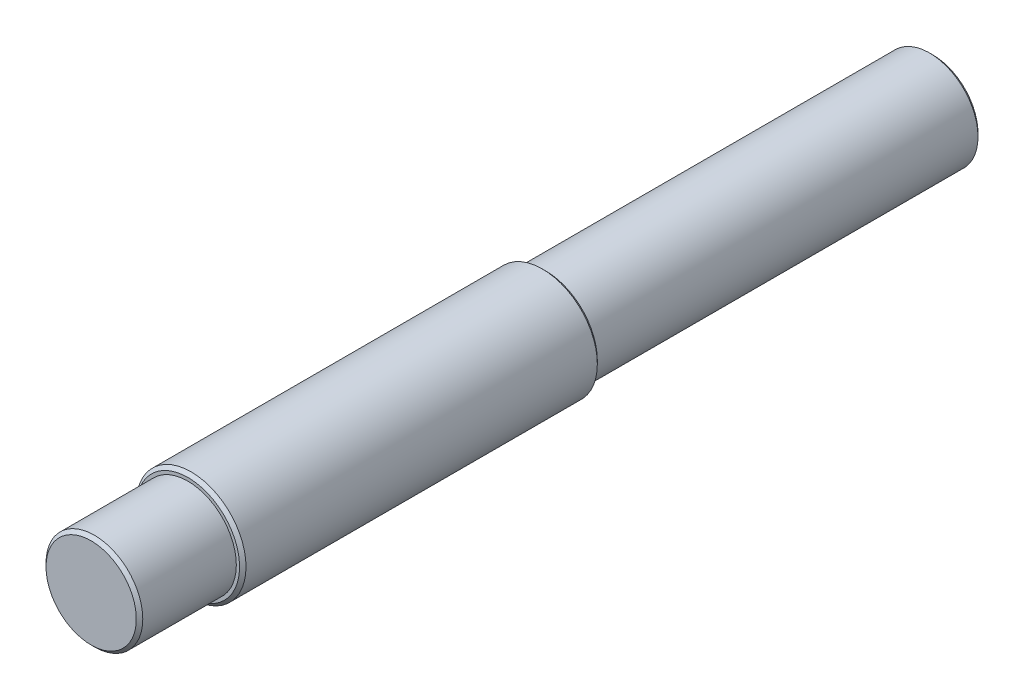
ISO-10303-21;
HEADER;
FILE_DESCRIPTION(('STEP AP214'),'2;1');
FILE_NAME('part.step','',(''),(''),'','','');
FILE_SCHEMA(('AUTOMOTIVE_DESIGN { 1 0 10303 214 1 1 1 1 }'));
ENDSEC;
DATA;
#1=APPLICATION_CONTEXT('core data for automotive mechanical design processes');
#2=APPLICATION_PROTOCOL_DEFINITION('international standard','automotive_design',2000,#1);
#3=PRODUCT_CONTEXT('',#1,'mechanical');
#4=PRODUCT('Part','Part','',(#3));
#5=PRODUCT_RELATED_PRODUCT_CATEGORY('part','',(#4));
#6=PRODUCT_DEFINITION_FORMATION('','',#4);
#7=PRODUCT_DEFINITION_CONTEXT('part definition',#1,'design');
#8=PRODUCT_DEFINITION('design','',#6,#7);
#9=PRODUCT_DEFINITION_SHAPE('','',#8);
#10=(LENGTH_UNIT() NAMED_UNIT(*) SI_UNIT(.MILLI.,.METRE.));
#11=(NAMED_UNIT(*) PLANE_ANGLE_UNIT() SI_UNIT($,.RADIAN.));
#12=(NAMED_UNIT(*) SI_UNIT($,.STERADIAN.) SOLID_ANGLE_UNIT());
#13=UNCERTAINTY_MEASURE_WITH_UNIT(LENGTH_MEASURE(1.E-05),#10,'distance_accuracy_value','');
#14=(GEOMETRIC_REPRESENTATION_CONTEXT(3) GLOBAL_UNCERTAINTY_ASSIGNED_CONTEXT((#13)) GLOBAL_UNIT_ASSIGNED_CONTEXT((#10,
#11,#12)) REPRESENTATION_CONTEXT('',''));
#15=CARTESIAN_POINT('',(0.,0.,0.));
#16=DIRECTION('',(0.,0.,1.));
#17=DIRECTION('',(1.,0.,0.));
#18=AXIS2_PLACEMENT_3D('',#15,#16,#17);
#19=CARTESIAN_POINT('',(0.,0.,13.045));
#20=DIRECTION('',(0.,0.,-1.));
#21=DIRECTION('',(-1.,0.,0.));
#22=AXIS2_PLACEMENT_3D('',#19,#20,#21);
#23=PLANE('',#22);
#24=CARTESIAN_POINT('',(0.,0.,13.045));
#25=DIRECTION('',(0.,0.,-1.));
#26=DIRECTION('',(-1.,0.,0.));
#27=AXIS2_PLACEMENT_3D('',#24,#25,#26);
#28=CIRCLE('',#27,1.40000000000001);
#29=CARTESIAN_POINT('',(-1.40000000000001,0.,13.045));
#30=VERTEX_POINT('',#29);
#31=EDGE_CURVE('E36',#30,#30,#28,.F.);
#32=ORIENTED_EDGE('',*,*,#31,.T.);
#33=EDGE_LOOP('',(#32));
#34=FACE_BOUND('',#33,.T.);
#35=ADVANCED_FACE('F29',(#34),#23,.F.);
#36=CARTESIAN_POINT('',(0.,0.,13.045));
#37=DIRECTION('',(0.,0.,1.));
#38=DIRECTION('',(1.,0.,0.));
#39=AXIS2_PLACEMENT_3D('',#36,#37,#38);
#40=CYLINDRICAL_SURFACE('',#39,1.5);
#41=CARTESIAN_POINT('',(0.,0.,12.945));
#42=DIRECTION('',(0.,0.,-1.));
#43=DIRECTION('',(-1.,0.,0.));
#44=AXIS2_PLACEMENT_3D('',#41,#42,#43);
#45=CIRCLE('',#44,1.5);
#46=CARTESIAN_POINT('',(-1.5,0.,12.945));
#47=VERTEX_POINT('',#46);
#48=EDGE_CURVE('E10',#47,#47,#45,.T.);
#49=ORIENTED_EDGE('',*,*,#48,.T.);
#50=EDGE_LOOP('',(#49));
#51=FACE_BOUND('',#50,.T.);
#52=CARTESIAN_POINT('',(0.,0.,10.045));
#53=DIRECTION('',(0.,0.,1.));
#54=DIRECTION('',(1.,0.,0.));
#55=AXIS2_PLACEMENT_3D('',#52,#53,#54);
#56=CIRCLE('',#55,1.5);
#57=CARTESIAN_POINT('',(1.5,0.,10.045));
#58=VERTEX_POINT('',#57);
#59=EDGE_CURVE('E61',#58,#58,#56,.T.);
#60=ORIENTED_EDGE('',*,*,#59,.T.);
#61=EDGE_LOOP('',(#60));
#62=FACE_BOUND('',#61,.T.);
#63=ADVANCED_FACE('F86',(#51,#62),#40,.T.);
#64=CARTESIAN_POINT('',(0.,1.5,10.045));
#65=DIRECTION('',(0.,0.,-1.));
#66=DIRECTION('',(-1.,0.,0.));
#67=AXIS2_PLACEMENT_3D('',#64,#65,#66);
#68=PLANE('',#67);
#69=CARTESIAN_POINT('',(0.,0.,10.045));
#70=DIRECTION('',(0.,0.,-1.));
#71=DIRECTION('',(-1.,0.,0.));
#72=AXIS2_PLACEMENT_3D('',#69,#70,#71);
#73=CIRCLE('',#72,1.6);
#74=CARTESIAN_POINT('',(-1.6,0.,10.045));
#75=VERTEX_POINT('',#74);
#76=EDGE_CURVE('E49',#75,#75,#73,.F.);
#77=ORIENTED_EDGE('',*,*,#76,.T.);
#78=EDGE_LOOP('',(#77));
#79=FACE_BOUND('',#78,.T.);
#80=ORIENTED_EDGE('',*,*,#59,.F.);
#81=EDGE_LOOP('',(#80));
#82=FACE_BOUND('',#81,.T.);
#83=ADVANCED_FACE('F91',(#79,#82),#68,.F.);
#84=CARTESIAN_POINT('',(0.,0.,13.045));
#85=DIRECTION('',(0.,0.,1.));
#86=DIRECTION('',(1.,0.,0.));
#87=AXIS2_PLACEMENT_3D('',#84,#85,#86);
#88=CYLINDRICAL_SURFACE('',#87,1.7);
#89=CARTESIAN_POINT('',(0.,0.,-0.945000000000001));
#90=DIRECTION('',(0.,0.,1.));
#91=DIRECTION('',(1.,0.,0.));
#92=AXIS2_PLACEMENT_3D('',#89,#90,#91);
#93=CIRCLE('',#92,1.7);
#94=CARTESIAN_POINT('',(1.7,0.,-0.945000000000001));
#95=VERTEX_POINT('',#94);
#96=EDGE_CURVE('E55',#95,#95,#93,.T.);
#97=ORIENTED_EDGE('',*,*,#96,.T.);
#98=EDGE_LOOP('',(#97));
#99=FACE_BOUND('',#98,.T.);
#100=CARTESIAN_POINT('',(0.,0.,9.94500000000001));
#101=DIRECTION('',(0.,0.,-1.));
#102=DIRECTION('',(-1.,0.,0.));
#103=AXIS2_PLACEMENT_3D('',#100,#101,#102);
#104=CIRCLE('',#103,1.7);
#105=CARTESIAN_POINT('',(-1.7,0.,9.94500000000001));
#106=VERTEX_POINT('',#105);
#107=EDGE_CURVE('E58',#106,#106,#104,.T.);
#108=ORIENTED_EDGE('',*,*,#107,.T.);
#109=EDGE_LOOP('',(#108));
#110=FACE_BOUND('',#109,.T.);
#111=ADVANCED_FACE('F82',(#99,#110),#88,.T.);
#112=CARTESIAN_POINT('',(0.,1.7,-1.045));
#113=DIRECTION('',(0.,0.,1.));
#114=DIRECTION('',(1.,0.,0.));
#115=AXIS2_PLACEMENT_3D('',#112,#113,#114);
#116=PLANE('',#115);
#117=CARTESIAN_POINT('',(0.,0.,-1.045));
#118=DIRECTION('',(0.,0.,1.));
#119=DIRECTION('',(1.,0.,0.));
#120=AXIS2_PLACEMENT_3D('',#117,#118,#119);
#121=CIRCLE('',#120,1.6);
#122=CARTESIAN_POINT('',(1.6,0.,-1.045));
#123=VERTEX_POINT('',#122);
#124=EDGE_CURVE('E52',#123,#123,#121,.F.);
#125=ORIENTED_EDGE('',*,*,#124,.T.);
#126=EDGE_LOOP('',(#125));
#127=FACE_BOUND('',#126,.T.);
#128=CARTESIAN_POINT('',(0.,0.,-1.045));
#129=DIRECTION('',(0.,0.,1.));
#130=DIRECTION('',(1.,0.,0.));
#131=AXIS2_PLACEMENT_3D('',#128,#129,#130);
#132=CIRCLE('',#131,1.5);
#133=CARTESIAN_POINT('',(1.5,0.,-1.045));
#134=VERTEX_POINT('',#133);
#135=EDGE_CURVE('E64',#134,#134,#132,.T.);
#136=ORIENTED_EDGE('',*,*,#135,.T.);
#137=EDGE_LOOP('',(#136));
#138=FACE_BOUND('',#137,.T.);
#139=ADVANCED_FACE('F68',(#127,#138),#116,.F.);
#140=CARTESIAN_POINT('',(0.,0.,13.045));
#141=DIRECTION('',(0.,0.,1.));
#142=DIRECTION('',(1.,0.,0.));
#143=AXIS2_PLACEMENT_3D('',#140,#141,#142);
#144=CYLINDRICAL_SURFACE('',#143,1.5);
#145=CARTESIAN_POINT('',(0.,0.,-12.945));
#146=DIRECTION('',(0.,0.,1.));
#147=DIRECTION('',(1.,0.,0.));
#148=AXIS2_PLACEMENT_3D('',#145,#146,#147);
#149=CIRCLE('',#148,1.5);
#150=CARTESIAN_POINT('',(1.5,0.,-12.945));
#151=VERTEX_POINT('',#150);
#152=EDGE_CURVE('E44',#151,#151,#149,.T.);
#153=ORIENTED_EDGE('',*,*,#152,.T.);
#154=EDGE_LOOP('',(#153));
#155=FACE_BOUND('',#154,.T.);
#156=ORIENTED_EDGE('',*,*,#135,.F.);
#157=EDGE_LOOP('',(#156));
#158=FACE_BOUND('',#157,.T.);
#159=ADVANCED_FACE('F70',(#155,#158),#144,.T.);
#160=CARTESIAN_POINT('',(0.,1.5,-13.045));
#161=DIRECTION('',(0.,0.,1.));
#162=DIRECTION('',(1.,0.,0.));
#163=AXIS2_PLACEMENT_3D('',#160,#161,#162);
#164=PLANE('',#163);
#165=CARTESIAN_POINT('',(0.,0.,-13.045));
#166=DIRECTION('',(0.,0.,1.));
#167=DIRECTION('',(1.,0.,0.));
#168=AXIS2_PLACEMENT_3D('',#165,#166,#167);
#169=CIRCLE('',#168,1.4);
#170=CARTESIAN_POINT('',(1.4,0.,-13.045));
#171=VERTEX_POINT('',#170);
#172=EDGE_CURVE('E40',#171,#171,#169,.F.);
#173=ORIENTED_EDGE('',*,*,#172,.T.);
#174=EDGE_LOOP('',(#173));
#175=FACE_BOUND('',#174,.T.);
#176=ADVANCED_FACE('F72',(#175),#164,.F.);
#177=CARTESIAN_POINT('',(0.,0.,-0.945000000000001));
#178=DIRECTION('',(0.,0.,1.));
#179=DIRECTION('',(1.,0.,0.));
#180=AXIS2_PLACEMENT_3D('',#177,#178,#179);
#181=CONICAL_SURFACE('',#180,1.7,0.785398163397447);
#182=ORIENTED_EDGE('',*,*,#124,.F.);
#183=EDGE_LOOP('',(#182));
#184=FACE_BOUND('',#183,.T.);
#185=ORIENTED_EDGE('',*,*,#96,.F.);
#186=EDGE_LOOP('',(#185));
#187=FACE_BOUND('',#186,.T.);
#188=ADVANCED_FACE('F79',(#184,#187),#181,.T.);
#189=CARTESIAN_POINT('',(0.,0.,10.045));
#190=DIRECTION('',(0.,0.,-1.));
#191=DIRECTION('',(-1.,0.,0.));
#192=AXIS2_PLACEMENT_3D('',#189,#190,#191);
#193=CONICAL_SURFACE('',#192,1.6,0.785398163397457);
#194=CARTESIAN_POINT('',(-1.7,0.,9.94500000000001));
#195=CARTESIAN_POINT('',(-1.69895833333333,0.,9.94604166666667));
#196=CARTESIAN_POINT('',(-1.69791666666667,0.,9.94708333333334));
#197=CARTESIAN_POINT('',(-1.69583333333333,0.,9.94916666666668));
#198=CARTESIAN_POINT('',(-1.69479166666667,0.,9.95020833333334));
#199=CARTESIAN_POINT('',(-1.69270833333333,0.,9.95229166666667));
#200=CARTESIAN_POINT('',(-1.69166666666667,0.,9.95333333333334));
#201=CARTESIAN_POINT('',(-1.68958333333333,0.,9.95541666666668));
#202=CARTESIAN_POINT('',(-1.68854166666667,0.,9.95645833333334));
#203=CARTESIAN_POINT('',(-1.68645833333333,0.,9.95854166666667));
#204=CARTESIAN_POINT('',(-1.68541666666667,0.,9.95958333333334));
#205=CARTESIAN_POINT('',(-1.68333333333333,0.,9.96166666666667));
#206=CARTESIAN_POINT('',(-1.68229166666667,0.,9.96270833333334));
#207=CARTESIAN_POINT('',(-1.68020833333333,0.,9.96479166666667));
#208=CARTESIAN_POINT('',(-1.67916666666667,0.,9.96583333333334));
#209=CARTESIAN_POINT('',(-1.67708333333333,0.,9.96791666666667));
#210=CARTESIAN_POINT('',(-1.67604166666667,0.,9.96895833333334));
#211=CARTESIAN_POINT('',(-1.67395833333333,0.,9.97104166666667));
#212=CARTESIAN_POINT('',(-1.67291666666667,0.,9.97208333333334));
#213=CARTESIAN_POINT('',(-1.67083333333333,0.,9.97416666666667));
#214=CARTESIAN_POINT('',(-1.66979166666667,0.,9.97520833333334));
#215=CARTESIAN_POINT('',(-1.66770833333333,0.,9.97729166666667));
#216=CARTESIAN_POINT('',(-1.66666666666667,0.,9.97833333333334));
#217=CARTESIAN_POINT('',(-1.66458333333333,0.,9.98041666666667));
#218=CARTESIAN_POINT('',(-1.66354166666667,0.,9.98145833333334));
#219=CARTESIAN_POINT('',(-1.66145833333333,0.,9.98354166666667));
#220=CARTESIAN_POINT('',(-1.66041666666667,0.,9.98458333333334));
#221=CARTESIAN_POINT('',(-1.65833333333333,0.,9.98666666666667));
#222=CARTESIAN_POINT('',(-1.65729166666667,0.,9.98770833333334));
#223=CARTESIAN_POINT('',(-1.65520833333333,0.,9.98979166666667));
#224=CARTESIAN_POINT('',(-1.65416666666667,0.,9.99083333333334));
#225=CARTESIAN_POINT('',(-1.65208333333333,0.,9.99291666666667));
#226=CARTESIAN_POINT('',(-1.65104166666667,0.,9.99395833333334));
#227=CARTESIAN_POINT('',(-1.64895833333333,0.,9.99604166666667));
#228=CARTESIAN_POINT('',(-1.64791666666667,0.,9.99708333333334));
#229=CARTESIAN_POINT('',(-1.64583333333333,0.,9.99916666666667));
#230=CARTESIAN_POINT('',(-1.64479166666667,0.,10.0002083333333));
#231=CARTESIAN_POINT('',(-1.64270833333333,0.,10.0022916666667));
#232=CARTESIAN_POINT('',(-1.64166666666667,0.,10.0033333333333));
#233=CARTESIAN_POINT('',(-1.63958333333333,0.,10.0054166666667));
#234=CARTESIAN_POINT('',(-1.63854166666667,0.,10.0064583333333));
#235=CARTESIAN_POINT('',(-1.63645833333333,0.,10.0085416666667));
#236=CARTESIAN_POINT('',(-1.63541666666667,0.,10.0095833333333));
#237=CARTESIAN_POINT('',(-1.63333333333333,0.,10.0116666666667));
#238=CARTESIAN_POINT('',(-1.63229166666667,0.,10.0127083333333));
#239=CARTESIAN_POINT('',(-1.63020833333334,0.,10.0147916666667));
#240=CARTESIAN_POINT('',(-1.62916666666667,0.,10.0158333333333));
#241=CARTESIAN_POINT('',(-1.62708333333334,0.,10.0179166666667));
#242=CARTESIAN_POINT('',(-1.62604166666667,0.,10.0189583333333));
#243=CARTESIAN_POINT('',(-1.62395833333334,0.,10.0210416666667));
#244=CARTESIAN_POINT('',(-1.62291666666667,0.,10.0220833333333));
#245=CARTESIAN_POINT('',(-1.62083333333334,0.,10.0241666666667));
#246=CARTESIAN_POINT('',(-1.61979166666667,0.,10.0252083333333));
#247=CARTESIAN_POINT('',(-1.61770833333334,0.,10.0272916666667));
#248=CARTESIAN_POINT('',(-1.61666666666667,0.,10.0283333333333));
#249=CARTESIAN_POINT('',(-1.61458333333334,0.,10.0304166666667));
#250=CARTESIAN_POINT('',(-1.61354166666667,0.,10.0314583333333));
#251=CARTESIAN_POINT('',(-1.61145833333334,0.,10.0335416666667));
#252=CARTESIAN_POINT('',(-1.61041666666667,0.,10.0345833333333));
#253=CARTESIAN_POINT('',(-1.60833333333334,0.,10.0366666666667));
#254=CARTESIAN_POINT('',(-1.60729166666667,0.,10.0377083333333));
#255=CARTESIAN_POINT('',(-1.60520833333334,0.,10.0397916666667));
#256=CARTESIAN_POINT('',(-1.60416666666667,0.,10.0408333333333));
#257=CARTESIAN_POINT('',(-1.60208333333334,0.,10.0429166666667));
#258=CARTESIAN_POINT('',(-1.60104166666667,0.,10.0439583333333));
#259=CARTESIAN_POINT('',(-1.6,0.,10.045));
#260=B_SPLINE_CURVE_WITH_KNOTS('',3,(#194,#195,#196,#197,#198,#199,#200,#201,#202,#203,#204,
#205,#206,#207,#208,#209,#210,#211,#212,#213,#214,#215,#216,#217,#218,#219,#220,#221,#222,#223,
#224,#225,#226,#227,#228,#229,#230,#231,#232,#233,#234,#235,#236,#237,#238,#239,#240,#241,#242,
#243,#244,#245,#246,#247,#248,#249,#250,#251,#252,#253,#254,#255,#256,#257,#258,#259),
.UNSPECIFIED.,.F.,.F.,(4,2,2,2,2,2,2,2,2,2,2,2,2,2,2,2,2,2,2,2,2,2,2,2,2,2,2,2,2,2,2,2,4),(0.,
0.00441941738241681,0.0088388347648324,0.013258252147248,0.0176776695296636,0.0220970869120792,
0.0265165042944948,0.0309359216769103,0.0353553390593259,0.0397747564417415,0.0441941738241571,
0.0486135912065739,0.0530330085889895,0.0574524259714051,0.0618718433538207,0.0662912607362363,
0.0707106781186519,0.0751300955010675,0.079549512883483,0.0839689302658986,0.0883883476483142,
0.0928077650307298,0.0972271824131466,0.101646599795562,0.106066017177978,0.110485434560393,
0.114904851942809,0.119324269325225,0.12374368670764,0.128163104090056,0.132582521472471,
0.137001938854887,0.141421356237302),.UNSPECIFIED.);
#261=EDGE_CURVE('BSEAM97',#106,#75,#260,.T.);
#262=ORIENTED_EDGE('',*,*,#107,.F.);
#263=ORIENTED_EDGE('',*,*,#76,.F.);
#264=ORIENTED_EDGE('',*,*,#261,.T.);
#265=ORIENTED_EDGE('',*,*,#261,.F.);
#266=EDGE_LOOP('',(#262,#264,#263,#265));
#267=FACE_BOUND('',#266,.T.);
#268=ADVANCED_FACE('F97',(#267),#193,.T.);
#269=CARTESIAN_POINT('',(0.,0.,-12.945));
#270=DIRECTION('',(0.,0.,1.));
#271=DIRECTION('',(1.,0.,0.));
#272=AXIS2_PLACEMENT_3D('',#269,#270,#271);
#273=CONICAL_SURFACE('',#272,1.5,0.785398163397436);
#274=ORIENTED_EDGE('',*,*,#172,.F.);
#275=EDGE_LOOP('',(#274));
#276=FACE_BOUND('',#275,.T.);
#277=ORIENTED_EDGE('',*,*,#152,.F.);
#278=EDGE_LOOP('',(#277));
#279=FACE_BOUND('',#278,.T.);
#280=ADVANCED_FACE('F100',(#276,#279),#273,.T.);
#281=CARTESIAN_POINT('',(0.,0.,13.045));
#282=DIRECTION('',(0.,0.,-1.));
#283=DIRECTION('',(-1.,0.,0.));
#284=AXIS2_PLACEMENT_3D('',#281,#282,#283);
#285=CONICAL_SURFACE('',#284,1.40000000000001,0.785398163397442);
#286=ORIENTED_EDGE('',*,*,#48,.F.);
#287=EDGE_LOOP('',(#286));
#288=FACE_BOUND('',#287,.T.);
#289=ORIENTED_EDGE('',*,*,#31,.F.);
#290=EDGE_LOOP('',(#289));
#291=FACE_BOUND('',#290,.T.);
#292=ADVANCED_FACE('F31',(#288,#291),#285,.T.);
#293=CLOSED_SHELL('',(#35,#63,#83,#111,#139,#159,#176,#188,#268,#280,#292));
#294=MANIFOLD_SOLID_BREP('B2',#293);
#295=ADVANCED_BREP_SHAPE_REPRESENTATION('',(#18,#294),#14);
#296=SHAPE_DEFINITION_REPRESENTATION(#9,#295);
ENDSEC;
END-ISO-10303-21;
